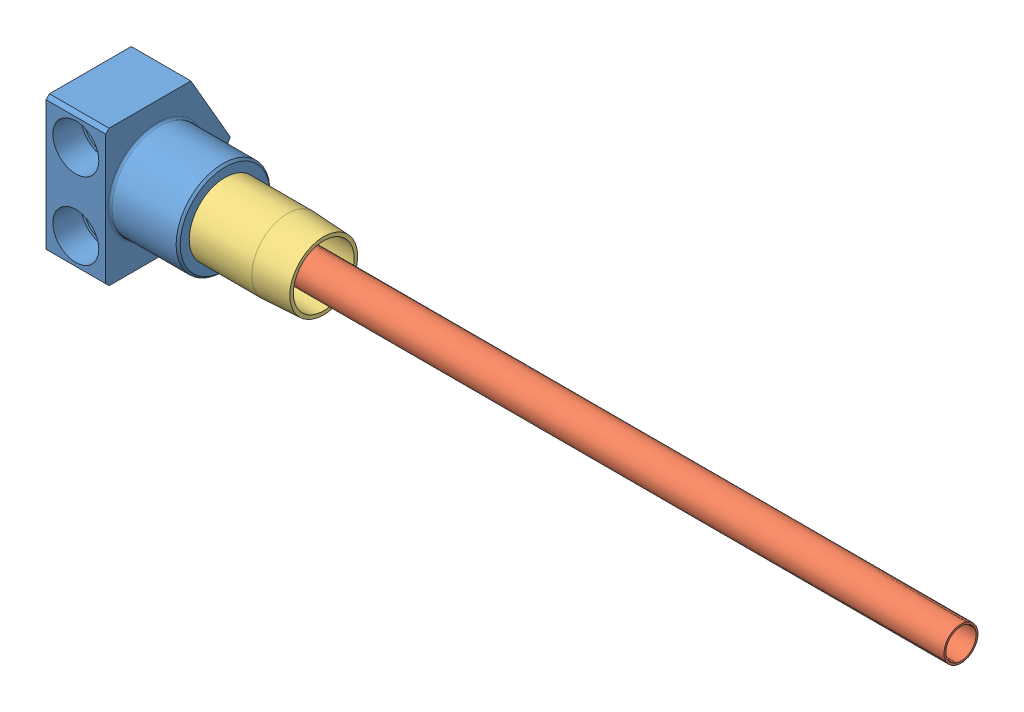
SolidWorks assembly CC3438.sldasm, configuration Default (file format 11000). Lengths in mm.
Overall size (321.69 50.8 46.41).
3 component instances, 3 part files, 4 mates.
Components (placement in the parent):
- CCH3438-1: CCH3438.sldprt [Default] at origin size (47.62 50.8 46.41)
- HFT500L12-1: HFT500L12.sldprt [Default] at (16.891 0 0) x (0 -0.323751 -0.946142) z (0 -0.946142 0.323751) size (14.29 304.8 14.29)
- CC3438_Pipe Nipple-1: CC3438_Pipe Nipple.sldprt [Default] at (33.5788 0 0) x (1 0 0) z (0 -0.01106 0.999939) size (50.8 26.67 26.67)
Mates (geometry in assembly coordinates):
- Concentric1: concentric: cylinder of HFT500L12-1 through (126.0058 0 0) axis (-1 0 0) radius 6.35; cylinder of CC3438_Pipe Nipple-1 through (33.5788 0 0) axis (-1 0 0) radius 11.3157
- Coincident1: coincident: plane of CCH3438-1 through (33.5788 6.477 0) normal (1 0 0); plane of CC3438_Pipe Nipple-1 through (33.5788 0.1252 -11.315) normal (-1 0 0)
- Concentric2: concentric: cone of CCH3438-1 through (47.625 0 0) axis (-1 0 0); cylinder of CC3438_Pipe Nipple-1 through (33.5788 0 0) axis (-1 0 0) radius 13.335
- Distance1: distance = 30.734 mm: plane of HFT500L12-1 through (16.891 1.8256 5.3351) normal (-1 0 0); plane of CCH3438-1 through (47.625 0 0) normal (1 0 0)
